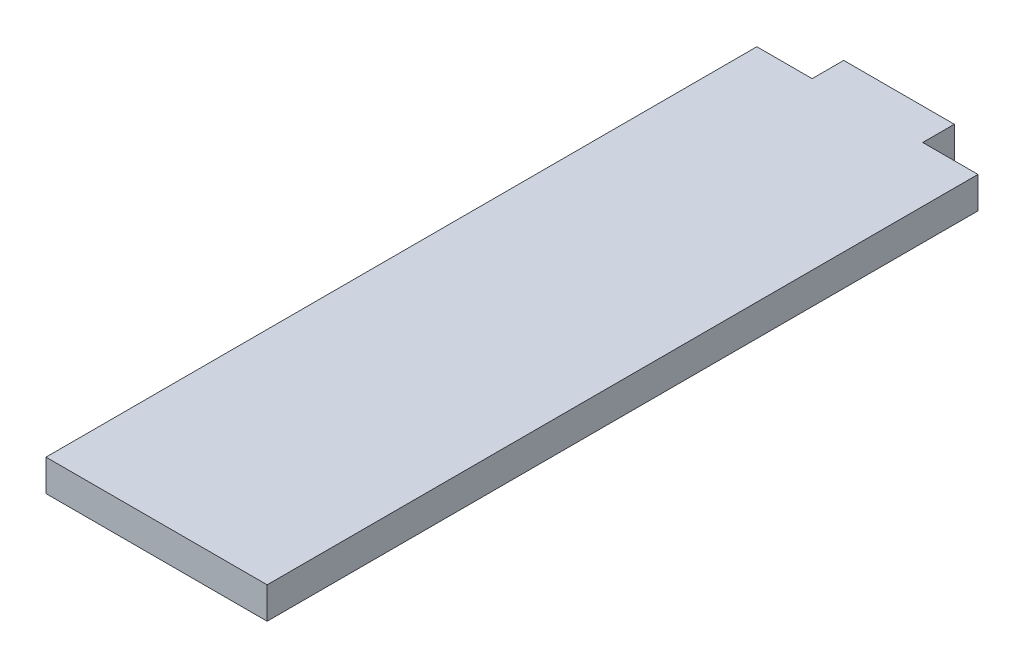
from build123d import *

# Parameters (mm, degrees)
BOSS_EXTRUDE1_DEPTH = 2


with BuildPart() as part:
    # Sketch1 → Boss-Extrude1 (new body)
    with BuildSketch(Plane(origin=(0, 0, 0), x_dir=(1, 0, 0), z_dir=(0, 1, 0))):
        Polygon((-3.5, 47), (3.5, 47), (3.5, 45), (7, 45), (7, 0), (-7, 0), (-7, 45), (-3.5, 45), align=None)
    extrude(amount=BOSS_EXTRUDE1_DEPTH)


solid = part.part
